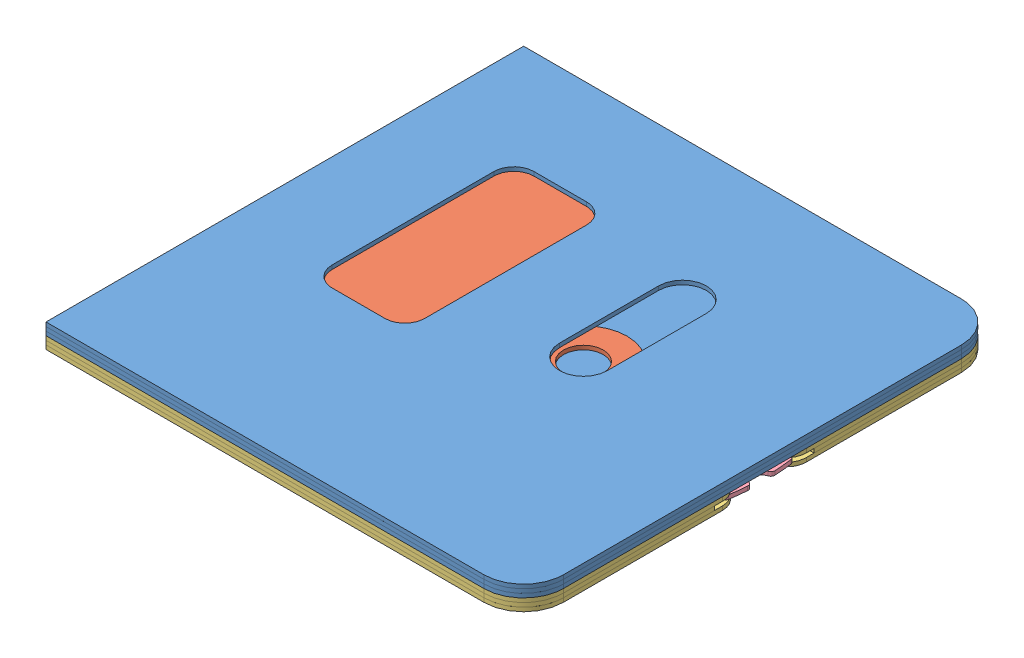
SolidWorks assembly Book Assembly.SLDASM, configuration Default (file format 14000). Lengths in mm.
Overall size (124.73 6 120).
4 component instances, 4 part files, 9 mates.
Components (placement in the parent):
- Page 4 and 5-1: Page 4 and 5.SLDPRT [Default] at (40.3762 72.8036 85.2473) size (120 3 120)
- Page 4 Slider-1: Page 4 Slider.SLDPRT [Default] at (40.3762 72.8036 85.2473) size (95.63 1 103.06)
- Page 6 and 7-1: Page 6 and 7.SLDPRT [Default] at (40.3762 69.8036 85.2473) size (120 3 120)
- Page 6 Slider-1: Page 6 Slider.SLDPRT [Default] at (40.4287 70.8036 85.8591) x (0.995671 0 -0.092943) z (0.092943 0 0.995671) size (106.75 1 106.54)
Mates (geometry in assembly coordinates):
- Coincident19: coincident anti-aligned: plane of Page 6 and 7-1 through (90.3366 70.8036 35.4431) normal (0 1 0); plane of Page 6 Slider-1 through (6.0218 70.8036 51.0578) normal (0 -1 0)
- Concentric1: concentric aligned: circle of Page 6 and 7-1; circle of Page 6 Slider-1
- Coincident20: coincident anti-aligned: plane of Page 4 and 5-1 through (97.402 73.8036 28.3777) normal (0 1 0); plane of Page 4 Slider-1 through (35.215 73.8036 49.1736) normal (0 -1 0)
- Slot3: slot anti-aligned: cylinder of ? through (55.4393 74.8036 85.5331) axis (0 -1 0) radius 5; plane of ? through (49.4393 74.8036 85.5331) normal (1 0 0); cylinder of ? through (55.4393 74.8036 85.5331) axis (0 1 0) radius 6
- Coincident24: coincident aligned: line of Page 4 and 5-1 through (-19.6634 72.8036 25.4431) axis (0 0 1); line of Page 6 and 7-1 through (-19.6634 72.8036 25.4431) axis (0 0 1)
- Coincident25: coincident: point of Page 4 and 5-1; point of Page 6 and 7-1
- LimitAngle1: limit planar angle anti-aligned: plane of Page 4 and 5-1 through (97.402 72.8036 28.3777) normal (0 -1 0); plane of Page 6 and 7-1 through (40.3762 72.8036 85.2473) normal (0 1 0)
- Coincident32: coincident: point of Page 4 and 5-1; point of Page 6 and 7-1
- Coincident36: coincident anti-aligned: line of Page 4 and 5-1 through (-8.6362 74.8036 83.2777) axis (0 0 -1); line of Page 4 Slider-1 through (-8.6362 74.8036 59.4968) axis (0 0 1)
